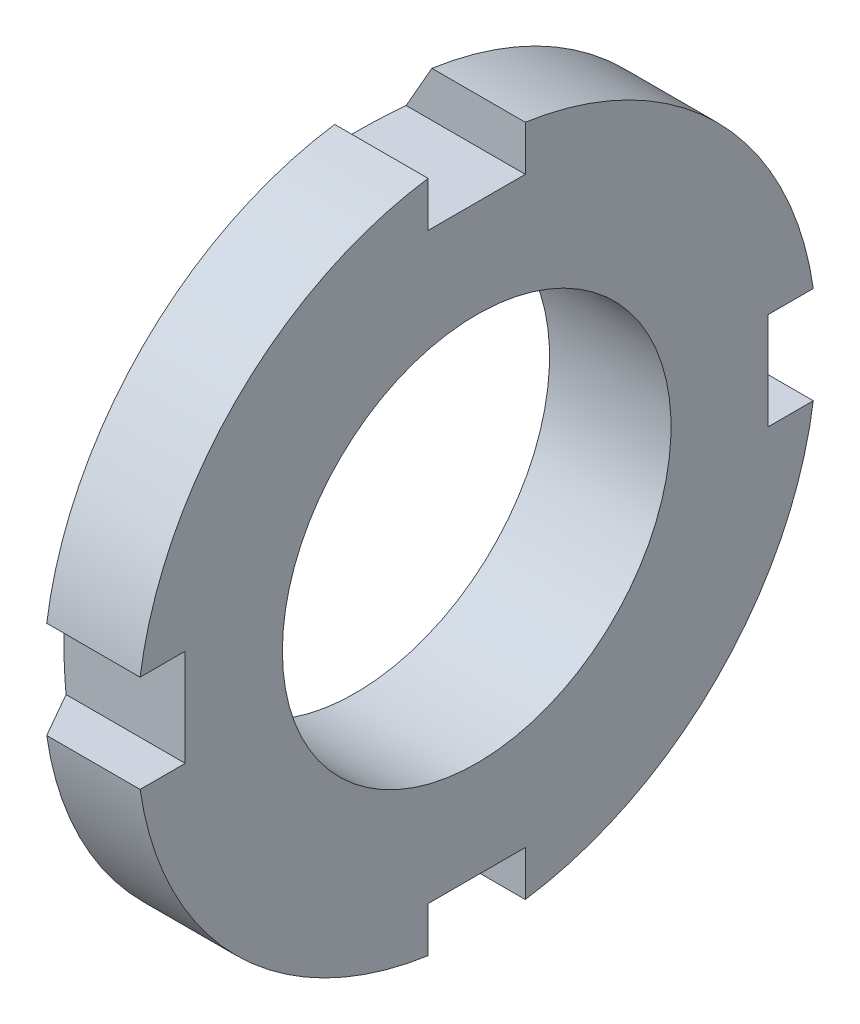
ISO-10303-21;
HEADER;
FILE_DESCRIPTION(('STEP AP214'),'2;1');
FILE_NAME('part.step','',(''),(''),'','','');
FILE_SCHEMA(('AUTOMOTIVE_DESIGN { 1 0 10303 214 1 1 1 1 }'));
ENDSEC;
DATA;
#1=APPLICATION_CONTEXT('core data for automotive mechanical design processes');
#2=APPLICATION_PROTOCOL_DEFINITION('international standard','automotive_design',2000,#1);
#3=PRODUCT_CONTEXT('',#1,'mechanical');
#4=PRODUCT('Part','Part','',(#3));
#5=PRODUCT_RELATED_PRODUCT_CATEGORY('part','',(#4));
#6=PRODUCT_DEFINITION_FORMATION('','',#4);
#7=PRODUCT_DEFINITION_CONTEXT('part definition',#1,'design');
#8=PRODUCT_DEFINITION('design','',#6,#7);
#9=PRODUCT_DEFINITION_SHAPE('','',#8);
#10=(LENGTH_UNIT() NAMED_UNIT(*) SI_UNIT(.MILLI.,.METRE.));
#11=(NAMED_UNIT(*) PLANE_ANGLE_UNIT() SI_UNIT($,.RADIAN.));
#12=(NAMED_UNIT(*) SI_UNIT($,.STERADIAN.) SOLID_ANGLE_UNIT());
#13=UNCERTAINTY_MEASURE_WITH_UNIT(LENGTH_MEASURE(1.E-05),#10,'distance_accuracy_value','');
#14=(GEOMETRIC_REPRESENTATION_CONTEXT(3) GLOBAL_UNCERTAINTY_ASSIGNED_CONTEXT((#13)) GLOBAL_UNIT_ASSIGNED_CONTEXT((#10,
#11,#12)) REPRESENTATION_CONTEXT('',''));
#15=CARTESIAN_POINT('',(0.,0.,0.));
#16=DIRECTION('',(0.,0.,1.));
#17=DIRECTION('',(1.,0.,0.));
#18=AXIS2_PLACEMENT_3D('',#15,#16,#17);
#19=CARTESIAN_POINT('',(1.15470053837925,0.,0.));
#20=DIRECTION('',(1.,0.,0.));
#21=DIRECTION('',(0.,0.,-1.));
#22=AXIS2_PLACEMENT_3D('',#19,#20,#21);
#23=CONICAL_SURFACE('',#22,14.,1.0471975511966);
#24=CARTESIAN_POINT('',(1.15470053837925,0.,0.));
#25=DIRECTION('',(-1.,0.,0.));
#26=DIRECTION('',(0.,0.,1.));
#27=AXIS2_PLACEMENT_3D('',#24,#25,#26);
#28=CIRCLE('',#27,14.);
#29=CARTESIAN_POINT('',(1.15470053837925,-13.856406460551,2.00000000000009));
#30=VERTEX_POINT('',#29);
#31=CARTESIAN_POINT('',(1.15470053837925,-1.99999999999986,13.856406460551));
#32=VERTEX_POINT('',#31);
#33=EDGE_CURVE('E387',#30,#32,#28,.T.);
#34=ORIENTED_EDGE('',*,*,#33,.T.);
#35=CARTESIAN_POINT('',(2.50004039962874,-1.99999999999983,16.2072617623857));
#36=CARTESIAN_POINT('',(2.12445509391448,-1.99999999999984,15.5517207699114));
#37=CARTESIAN_POINT('',(1.74906807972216,-1.99999999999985,14.8960654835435));
#38=CARTESIAN_POINT('',(0.999065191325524,-1.99999999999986,13.584317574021));
#39=CARTESIAN_POINT('',(0.624449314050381,-1.99999999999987,12.9282249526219));
#40=CARTESIAN_POINT('',(0.0633818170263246,-1.99999999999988,11.943596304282));
#41=CARTESIAN_POINT('',(-0.12349831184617,-1.99999999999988,11.6153045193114));
#42=CARTESIAN_POINT('',(-0.496883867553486,-1.99999999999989,10.9585081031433));
#43=CARTESIAN_POINT('',(-0.683389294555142,-1.99999999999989,10.6300034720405));
#44=CARTESIAN_POINT('',(-1.05591906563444,-1.9999999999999,9.97271962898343));
#45=CARTESIAN_POINT('',(-1.24194340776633,-1.9999999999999,9.64394041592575));
#46=CARTESIAN_POINT('',(-1.61332792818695,-1.99999999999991,8.98600649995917));
#47=CARTESIAN_POINT('',(-1.79868810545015,-1.99999999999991,8.65685179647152));
#48=CARTESIAN_POINT('',(-1.98362475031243,-1.99999999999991,8.32745873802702));
#49=B_SPLINE_CURVE_WITH_KNOTS('',3,(#35,#36,#37,#38,#39,#40,#41,#42,#43,#44,#45,#46,#47,#48),
.UNSPECIFIED.,.F.,.F.,(4,2,2,2,2,2,4),(0.,2.2665367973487,4.53306455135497,5.66633267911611,
6.7996003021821,7.93287250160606,9.06614645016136),.UNSPECIFIED.);
#50=CARTESIAN_POINT('',(0.0955659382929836,-1.99999999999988,12.));
#51=VERTEX_POINT('',#50);
#52=EDGE_CURVE('E204',#32,#51,#49,.T.);
#53=ORIENTED_EDGE('',*,*,#52,.T.);
#54=CARTESIAN_POINT('',(1.87795299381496,-9.4151559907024,12.0000000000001));
#55=CARTESIAN_POINT('',(1.76332119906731,-9.09343548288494,12.0000000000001));
#56=CARTESIAN_POINT('',(1.65186650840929,-8.7705581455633,12.0000000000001));
#57=CARTESIAN_POINT('',(1.43640574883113,-8.12223353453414,12.0000000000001));
#58=CARTESIAN_POINT('',(1.3324017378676,-7.79678557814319,12.0000000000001));
#59=CARTESIAN_POINT('',(1.13265277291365,-7.14209874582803,12.0000000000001));
#60=CARTESIAN_POINT('',(1.03693794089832,-6.81285059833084,12.0000000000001));
#61=CARTESIAN_POINT('',(0.855502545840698,-6.15166020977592,12.0000000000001));
#62=CARTESIAN_POINT('',(0.769781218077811,-5.81971817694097,12.0000000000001));
#63=CARTESIAN_POINT('',(0.533895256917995,-4.83703268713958,12.));
#64=CARTESIAN_POINT('',(0.399640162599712,-4.18226816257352,12.));
#65=CARTESIAN_POINT('',(0.23890366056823,-3.19408498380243,12.));
#66=CARTESIAN_POINT('',(0.192115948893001,-2.8638952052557,12.));
#67=CARTESIAN_POINT('',(0.113172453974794,-2.20175423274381,12.));
#68=CARTESIAN_POINT('',(0.0810157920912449,-1.86980314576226,12.));
#69=CARTESIAN_POINT('',(0.0367602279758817,-1.26660614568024,12.));
#70=CARTESIAN_POINT('',(0.0220435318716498,-0.995549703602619,12.));
#71=CARTESIAN_POINT('',(0.00317374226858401,-0.453047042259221,12.));
#72=CARTESIAN_POINT('',(-0.000978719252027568,-0.181600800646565,12.));
#73=CARTESIAN_POINT('',(0.00136769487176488,0.36143217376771,12.));
#74=CARTESIAN_POINT('',(0.00787393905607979,0.633018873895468,12.));
#75=CARTESIAN_POINT('',(0.0314205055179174,1.17571298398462,12.));
#76=CARTESIAN_POINT('',(0.0484600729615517,1.44682042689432,12.));
#77=CARTESIAN_POINT('',(0.0932077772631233,1.99386044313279,12.));
#78=CARTESIAN_POINT('',(0.121131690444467,2.26977527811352,12.));
#79=CARTESIAN_POINT('',(0.187088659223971,2.82040723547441,12.));
#80=CARTESIAN_POINT('',(0.225122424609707,3.0951242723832,12.));
#81=CARTESIAN_POINT('',(0.310597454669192,3.64282065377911,12.));
#82=CARTESIAN_POINT('',(0.358030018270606,3.91580136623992,12.));
#83=CARTESIAN_POINT('',(0.461564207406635,4.46005610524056,12.));
#84=CARTESIAN_POINT('',(0.517663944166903,4.73133049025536,12.));
#85=CARTESIAN_POINT('',(0.577727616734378,5.00169907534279,11.9999999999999));
#86=B_SPLINE_CURVE_WITH_KNOTS('',3,(#54,#55,#56,#57,#58,#59,#60,#61,#62,#63,#64,#65,#66,#67,#68,
#69,#70,#71,#72,#73,#74,#75,#76,#77,#78,#79,#80,#81,#82,#83,#84,#85),.UNSPECIFIED.,.F.,.F.,(4,2,
2,2,2,2,2,2,2,2,2,2,2,2,2,4),(0.,1.02461389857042,2.04950972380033,3.07798598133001,
4.10638348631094,6.10932102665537,7.10952575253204,8.10967040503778,8.9238446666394,
9.7380676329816,10.5528537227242,11.3675814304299,12.199357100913,13.0311911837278,
13.8622587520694,14.6931454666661),.UNSPECIFIED.);
#87=CARTESIAN_POINT('',(0.,1.25693400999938E-13,12.));
#88=VERTEX_POINT('',#87);
#89=EDGE_CURVE('E186',#51,#88,#86,.T.);
#90=ORIENTED_EDGE('',*,*,#89,.T.);
#91=CARTESIAN_POINT('',(0.,0.,0.));
#92=DIRECTION('',(-1.,0.,0.));
#93=DIRECTION('',(0.,0.,1.));
#94=AXIS2_PLACEMENT_3D('',#91,#92,#93);
#95=CIRCLE('',#94,12.);
#96=CARTESIAN_POINT('',(0.,-12.,0.));
#97=VERTEX_POINT('',#96);
#98=EDGE_CURVE('E412',#97,#88,#95,.T.);
#99=ORIENTED_EDGE('',*,*,#98,.F.);
#100=CARTESIAN_POINT('',(1.87795299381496,-12.0000000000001,-9.41515599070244));
#101=CARTESIAN_POINT('',(1.76332119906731,-12.0000000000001,-9.09343548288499));
#102=CARTESIAN_POINT('',(1.65186650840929,-12.0000000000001,-8.77055814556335));
#103=CARTESIAN_POINT('',(1.43640574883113,-12.0000000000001,-8.12223353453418));
#104=CARTESIAN_POINT('',(1.3324017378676,-12.0000000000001,-7.79678557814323));
#105=CARTESIAN_POINT('',(1.13265277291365,-12.,-7.14209874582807));
#106=CARTESIAN_POINT('',(1.03693794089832,-12.,-6.81285059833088));
#107=CARTESIAN_POINT('',(0.855502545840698,-12.,-6.15166020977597));
#108=CARTESIAN_POINT('',(0.76978121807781,-12.,-5.81971817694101));
#109=CARTESIAN_POINT('',(0.533895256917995,-12.,-4.83703268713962));
#110=CARTESIAN_POINT('',(0.399640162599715,-12.,-4.18226816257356));
#111=CARTESIAN_POINT('',(0.23890366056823,-12.,-3.19408498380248));
#112=CARTESIAN_POINT('',(0.192115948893,-12.,-2.86389520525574));
#113=CARTESIAN_POINT('',(0.113172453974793,-12.,-2.20175423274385));
#114=CARTESIAN_POINT('',(0.0810157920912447,-12.,-1.8698031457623));
#115=CARTESIAN_POINT('',(0.0367602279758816,-12.,-1.26660614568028));
#116=CARTESIAN_POINT('',(0.022043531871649,-12.,-0.995549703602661));
#117=CARTESIAN_POINT('',(0.0031737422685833,-12.,-0.453047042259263));
#118=CARTESIAN_POINT('',(-0.000978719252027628,-12.,-0.181600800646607));
#119=CARTESIAN_POINT('',(0.00136769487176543,-12.,0.361432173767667));
#120=CARTESIAN_POINT('',(0.00787393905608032,-12.,0.633018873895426));
#121=CARTESIAN_POINT('',(0.0314205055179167,-12.,1.17571298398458));
#122=CARTESIAN_POINT('',(0.0484600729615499,-12.,1.44682042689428));
#123=CARTESIAN_POINT('',(0.0932077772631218,-12.,1.99386044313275));
#124=CARTESIAN_POINT('',(0.121131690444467,-12.,2.26977527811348));
#125=CARTESIAN_POINT('',(0.187088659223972,-12.,2.82040723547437));
#126=CARTESIAN_POINT('',(0.225122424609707,-12.,3.09512427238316));
#127=CARTESIAN_POINT('',(0.310597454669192,-12.,3.64282065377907));
#128=CARTESIAN_POINT('',(0.358030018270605,-12.,3.91580136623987));
#129=CARTESIAN_POINT('',(0.461564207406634,-12.,4.46005610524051));
#130=CARTESIAN_POINT('',(0.517663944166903,-12.,4.73133049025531));
#131=CARTESIAN_POINT('',(0.577727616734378,-12.,5.00169907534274));
#132=B_SPLINE_CURVE_WITH_KNOTS('',3,(#100,#101,#102,#103,#104,#105,#106,#107,#108,#109,#110,
#111,#112,#113,#114,#115,#116,#117,#118,#119,#120,#121,#122,#123,#124,#125,#126,#127,#128,#129,
#130,#131),.UNSPECIFIED.,.F.,.F.,(4,2,2,2,2,2,2,2,2,2,2,2,2,2,2,4),(0.,1.02461389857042,
2.04950972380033,3.07798598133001,4.10638348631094,6.10932102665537,7.10952575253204,
8.10967040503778,8.9238446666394,9.7380676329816,10.5528537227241,11.3675814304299,
12.199357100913,13.0311911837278,13.8622587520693,14.6931454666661),.UNSPECIFIED.);
#133=CARTESIAN_POINT('',(0.0955659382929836,-12.,2.00000000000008));
#134=VERTEX_POINT('',#133);
#135=EDGE_CURVE('E218',#97,#134,#132,.T.);
#136=ORIENTED_EDGE('',*,*,#135,.T.);
#137=CARTESIAN_POINT('',(-1.20351332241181,-9.71165401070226,2.00000000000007));
#138=CARTESIAN_POINT('',(-1.01756214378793,-10.0404733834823,2.00000000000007));
#139=CARTESIAN_POINT('',(-0.831334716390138,-10.3691362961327,2.00000000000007));
#140=CARTESIAN_POINT('',(-0.45843760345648,-11.0262108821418,2.00000000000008));
#141=CARTESIAN_POINT('',(-0.271767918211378,-11.3546225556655,2.00000000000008));
#142=CARTESIAN_POINT('',(0.288738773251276,-12.3395725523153,2.00000000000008));
#143=CARTESIAN_POINT('',(0.663074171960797,-12.9958271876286,2.00000000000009));
#144=CARTESIAN_POINT('',(1.41257640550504,-14.3078598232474,2.0000000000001));
#145=CARTESIAN_POINT('',(1.78774323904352,-14.9636378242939,2.0000000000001));
#146=CARTESIAN_POINT('',(2.53866102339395,-16.2748611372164,2.00000000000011));
#147=CARTESIAN_POINT('',(2.91441197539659,-16.9303064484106,2.00000000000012));
#148=CARTESIAN_POINT('',(3.290330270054,-17.5856555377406,2.00000000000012));
#149=B_SPLINE_CURVE_WITH_KNOTS('',3,(#137,#138,#139,#140,#141,#142,#143,#144,#145,#146,#147,
#148),.UNSPECIFIED.,.F.,.F.,(4,2,2,2,2,4),(0.,1.1332692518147,2.26653775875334,4.53307016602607,
6.79959904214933,9.06613254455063),.UNSPECIFIED.);
#150=EDGE_CURVE('E531',#134,#30,#149,.T.);
#151=ORIENTED_EDGE('',*,*,#150,.T.);
#152=EDGE_LOOP('',(#34,#53,#90,#99,#136,#151));
#153=FACE_BOUND('',#152,.T.);
#154=ADVANCED_FACE('F32',(#153),#23,.T.);
#155=CARTESIAN_POINT('',(0.,0.,0.));
#156=DIRECTION('',(-1.,0.,0.));
#157=DIRECTION('',(0.,0.,1.));
#158=AXIS2_PLACEMENT_3D('',#155,#156,#157);
#159=CYLINDRICAL_SURFACE('',#158,14.);
#160=CARTESIAN_POINT('',(5.,0.,0.));
#161=DIRECTION('',(-1.,0.,0.));
#162=DIRECTION('',(0.,0.,1.));
#163=AXIS2_PLACEMENT_3D('',#160,#161,#162);
#164=CIRCLE('',#163,14.);
#165=CARTESIAN_POINT('',(5.,-13.856406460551,2.00000000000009));
#166=VERTEX_POINT('',#165);
#167=CARTESIAN_POINT('',(5.,-1.99999999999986,13.856406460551));
#168=VERTEX_POINT('',#167);
#169=EDGE_CURVE('E363',#166,#168,#164,.T.);
#170=ORIENTED_EDGE('',*,*,#169,.T.);
#171=DIRECTION('',(-1.,0.,0.));
#172=VECTOR('',#171,1.);
#173=CARTESIAN_POINT('',(0.,-1.99999999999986,13.856406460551));
#174=LINE('',#173,#172);
#175=EDGE_CURVE('E212',#168,#32,#174,.T.);
#176=ORIENTED_EDGE('',*,*,#175,.T.);
#177=ORIENTED_EDGE('',*,*,#33,.F.);
#178=DIRECTION('',(-1.,0.,0.));
#179=VECTOR('',#178,1.);
#180=CARTESIAN_POINT('',(0.,-13.856406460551,2.00000000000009));
#181=LINE('',#180,#179);
#182=EDGE_CURVE('E226',#30,#166,#181,.F.);
#183=ORIENTED_EDGE('',*,*,#182,.T.);
#184=EDGE_LOOP('',(#170,#176,#177,#183));
#185=FACE_BOUND('',#184,.T.);
#186=ADVANCED_FACE('F426',(#185),#159,.T.);
#187=CARTESIAN_POINT('',(1.15470053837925,-2.00000000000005,-13.856406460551));
#188=VERTEX_POINT('',#187);
#189=CARTESIAN_POINT('',(1.15470053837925,-13.856406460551,-1.99999999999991));
#190=VERTEX_POINT('',#189);
#191=EDGE_CURVE('E347',#188,#190,#28,.T.);
#192=ORIENTED_EDGE('',*,*,#191,.T.);
#193=CARTESIAN_POINT('',(3.29033027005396,-17.5856555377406,-1.99999999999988));
#194=CARTESIAN_POINT('',(2.91441197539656,-16.9303064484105,-1.99999999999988));
#195=CARTESIAN_POINT('',(2.53866102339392,-16.2748611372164,-1.99999999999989));
#196=CARTESIAN_POINT('',(1.7877432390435,-14.9636378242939,-1.9999999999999));
#197=CARTESIAN_POINT('',(1.41257640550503,-14.3078598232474,-1.9999999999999));
#198=CARTESIAN_POINT('',(0.663074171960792,-12.9958271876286,-1.99999999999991));
#199=CARTESIAN_POINT('',(0.288738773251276,-12.3395725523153,-1.99999999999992));
#200=CARTESIAN_POINT('',(-0.271767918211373,-11.3546225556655,-1.99999999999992));
#201=CARTESIAN_POINT('',(-0.458437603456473,-11.0262108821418,-1.99999999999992));
#202=CARTESIAN_POINT('',(-0.831334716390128,-10.3691362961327,-1.99999999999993));
#203=CARTESIAN_POINT('',(-1.01756214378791,-10.0404733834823,-1.99999999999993));
#204=CARTESIAN_POINT('',(-1.20351332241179,-9.71165401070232,-1.99999999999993));
#205=B_SPLINE_CURVE_WITH_KNOTS('',3,(#193,#194,#195,#196,#197,#198,#199,#200,#201,#202,#203,
#204),.UNSPECIFIED.,.F.,.F.,(4,2,2,2,2,4),(0.,2.26653350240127,4.5330623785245,6.79959478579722,
7.93286329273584,9.06613254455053),.UNSPECIFIED.);
#206=CARTESIAN_POINT('',(0.095565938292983,-12.,-1.99999999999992));
#207=VERTEX_POINT('',#206);
#208=EDGE_CURVE('E241',#190,#207,#205,.T.);
#209=ORIENTED_EDGE('',*,*,#208,.T.);
#210=EDGE_CURVE('E225',#207,#97,#132,.T.);
#211=ORIENTED_EDGE('',*,*,#210,.T.);
#212=CARTESIAN_POINT('',(0.,0.,-12.));
#213=VERTEX_POINT('',#212);
#214=EDGE_CURVE('E337',#213,#97,#95,.T.);
#215=ORIENTED_EDGE('',*,*,#214,.F.);
#216=CARTESIAN_POINT('',(0.577727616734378,5.00169907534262,-12.));
#217=CARTESIAN_POINT('',(0.517663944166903,4.73133049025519,-12.));
#218=CARTESIAN_POINT('',(0.461564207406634,4.46005610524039,-12.));
#219=CARTESIAN_POINT('',(0.358030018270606,3.91580136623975,-12.));
#220=CARTESIAN_POINT('',(0.310597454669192,3.64282065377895,-12.));
#221=CARTESIAN_POINT('',(0.225122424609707,3.09512427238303,-12.));
#222=CARTESIAN_POINT('',(0.187088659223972,2.82040723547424,-12.));
#223=CARTESIAN_POINT('',(0.121131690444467,2.26977527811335,-12.));
#224=CARTESIAN_POINT('',(0.0932077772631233,1.99386044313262,-12.));
#225=CARTESIAN_POINT('',(0.0484600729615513,1.44682042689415,-12.));
#226=CARTESIAN_POINT('',(0.0314205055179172,1.17571298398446,-12.));
#227=CARTESIAN_POINT('',(0.00787393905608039,0.633018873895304,-12.));
#228=CARTESIAN_POINT('',(0.001367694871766,0.361432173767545,-12.));
#229=CARTESIAN_POINT('',(-0.000978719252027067,-0.181600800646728,-12.));
#230=CARTESIAN_POINT('',(0.00317374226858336,-0.453047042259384,-12.));
#231=CARTESIAN_POINT('',(0.0220435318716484,-0.995549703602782,-12.));
#232=CARTESIAN_POINT('',(0.0367602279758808,-1.2666061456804,-12.));
#233=CARTESIAN_POINT('',(0.0810157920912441,-1.86980314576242,-12.));
#234=CARTESIAN_POINT('',(0.113172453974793,-2.20175423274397,-12.));
#235=CARTESIAN_POINT('',(0.192115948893,-2.86389520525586,-12.));
#236=CARTESIAN_POINT('',(0.238903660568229,-3.1940849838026,-12.));
#237=CARTESIAN_POINT('',(0.399640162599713,-4.18226816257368,-12.));
#238=CARTESIAN_POINT('',(0.533895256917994,-4.83703268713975,-12.));
#239=CARTESIAN_POINT('',(0.769781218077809,-5.81971817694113,-12.));
#240=CARTESIAN_POINT('',(0.855502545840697,-6.15166020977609,-12.));
#241=CARTESIAN_POINT('',(1.03693794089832,-6.81285059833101,-12.));
#242=CARTESIAN_POINT('',(1.13265277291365,-7.14209874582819,-12.));
#243=CARTESIAN_POINT('',(1.3324017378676,-7.79678557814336,-12.));
#244=CARTESIAN_POINT('',(1.43640574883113,-8.12223353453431,-12.));
#245=CARTESIAN_POINT('',(1.65186650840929,-8.77055814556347,-12.));
#246=CARTESIAN_POINT('',(1.76332119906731,-9.09343548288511,-12.));
#247=CARTESIAN_POINT('',(1.87795299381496,-9.41515599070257,-12.));
#248=B_SPLINE_CURVE_WITH_KNOTS('',3,(#216,#217,#218,#219,#220,#221,#222,#223,#224,#225,#226,
#227,#228,#229,#230,#231,#232,#233,#234,#235,#236,#237,#238,#239,#240,#241,#242,#243,#244,#245,
#246,#247),.UNSPECIFIED.,.F.,.F.,(4,2,2,2,2,2,2,2,2,2,2,2,2,2,2,4),(0.,0.830886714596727,
1.66195428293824,2.49378836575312,3.32556403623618,4.14029174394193,4.95507783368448,
5.76930080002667,6.5834750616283,7.58361971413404,8.5838244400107,10.5867619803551,
11.6151594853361,12.6436357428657,13.6685315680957,14.6931454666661),.UNSPECIFIED.);
#249=CARTESIAN_POINT('',(0.095565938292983,-2.00000000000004,-12.));
#250=VERTEX_POINT('',#249);
#251=EDGE_CURVE('E257',#213,#250,#248,.T.);
#252=ORIENTED_EDGE('',*,*,#251,.T.);
#253=CARTESIAN_POINT('',(-1.20351332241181,-2.00000000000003,-9.71165401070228));
#254=CARTESIAN_POINT('',(-1.01756214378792,-2.00000000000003,-10.0404733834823));
#255=CARTESIAN_POINT('',(-0.831334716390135,-2.00000000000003,-10.3691362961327));
#256=CARTESIAN_POINT('',(-0.458437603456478,-2.00000000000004,-11.0262108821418));
#257=CARTESIAN_POINT('',(-0.271767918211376,-2.00000000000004,-11.3546225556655));
#258=CARTESIAN_POINT('',(0.288738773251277,-2.00000000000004,-12.3395725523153));
#259=CARTESIAN_POINT('',(0.663074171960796,-2.00000000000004,-12.9958271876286));
#260=CARTESIAN_POINT('',(1.41257640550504,-2.00000000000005,-14.3078598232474));
#261=CARTESIAN_POINT('',(1.78774323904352,-2.00000000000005,-14.9636378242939));
#262=CARTESIAN_POINT('',(2.53866102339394,-2.00000000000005,-16.2748611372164));
#263=CARTESIAN_POINT('',(2.91441197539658,-2.00000000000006,-16.9303064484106));
#264=CARTESIAN_POINT('',(3.29033027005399,-2.00000000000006,-17.5856555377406));
#265=B_SPLINE_CURVE_WITH_KNOTS('',3,(#253,#254,#255,#256,#257,#258,#259,#260,#261,#262,#263,
#264),.UNSPECIFIED.,.F.,.F.,(4,2,2,2,2,4),(0.,1.1332692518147,2.26653775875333,4.53307016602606,
6.79959904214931,9.0661325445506),.UNSPECIFIED.);
#266=EDGE_CURVE('E396',#250,#188,#265,.T.);
#267=ORIENTED_EDGE('',*,*,#266,.T.);
#268=EDGE_LOOP('',(#192,#209,#211,#215,#252,#267));
#269=FACE_BOUND('',#268,.T.);
#270=ADVANCED_FACE('F394',(#269),#23,.T.);
#271=CARTESIAN_POINT('',(5.,-2.00000000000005,-13.856406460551));
#272=VERTEX_POINT('',#271);
#273=CARTESIAN_POINT('',(5.,-13.856406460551,-1.99999999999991));
#274=VERTEX_POINT('',#273);
#275=EDGE_CURVE('E342',#272,#274,#164,.T.);
#276=ORIENTED_EDGE('',*,*,#275,.T.);
#277=DIRECTION('',(-1.,0.,0.));
#278=VECTOR('',#277,1.);
#279=CARTESIAN_POINT('',(0.,-13.856406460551,-1.99999999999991));
#280=LINE('',#279,#278);
#281=EDGE_CURVE('E249',#274,#190,#280,.T.);
#282=ORIENTED_EDGE('',*,*,#281,.T.);
#283=ORIENTED_EDGE('',*,*,#191,.F.);
#284=DIRECTION('',(-1.,0.,0.));
#285=VECTOR('',#284,1.);
#286=CARTESIAN_POINT('',(0.,-2.00000000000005,-13.856406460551));
#287=LINE('',#286,#285);
#288=EDGE_CURVE('E265',#188,#272,#287,.F.);
#289=ORIENTED_EDGE('',*,*,#288,.T.);
#290=EDGE_LOOP('',(#276,#282,#283,#289));
#291=FACE_BOUND('',#290,.T.);
#292=ADVANCED_FACE('F360',(#291),#159,.T.);
#293=CARTESIAN_POINT('',(1.15470053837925,13.856406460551,-2.));
#294=VERTEX_POINT('',#293);
#295=CARTESIAN_POINT('',(1.15470053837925,1.99999999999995,-13.856406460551));
#296=VERTEX_POINT('',#295);
#297=EDGE_CURVE('E343',#294,#296,#28,.T.);
#298=ORIENTED_EDGE('',*,*,#297,.T.);
#299=CARTESIAN_POINT('',(3.29033027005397,1.99999999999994,-17.5856555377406));
#300=CARTESIAN_POINT('',(2.91441197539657,1.99999999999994,-16.9303064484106));
#301=CARTESIAN_POINT('',(2.53866102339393,1.99999999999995,-16.2748611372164));
#302=CARTESIAN_POINT('',(1.78774323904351,1.99999999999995,-14.9636378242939));
#303=CARTESIAN_POINT('',(1.41257640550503,1.99999999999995,-14.3078598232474));
#304=CARTESIAN_POINT('',(0.663074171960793,1.99999999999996,-12.9958271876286));
#305=CARTESIAN_POINT('',(0.288738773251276,1.99999999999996,-12.3395725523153));
#306=CARTESIAN_POINT('',(-0.271767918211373,1.99999999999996,-11.3546225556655));
#307=CARTESIAN_POINT('',(-0.458437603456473,1.99999999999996,-11.0262108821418));
#308=CARTESIAN_POINT('',(-0.831334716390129,1.99999999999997,-10.3691362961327));
#309=CARTESIAN_POINT('',(-1.01756214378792,1.99999999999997,-10.0404733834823));
#310=CARTESIAN_POINT('',(-1.2035133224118,1.99999999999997,-9.71165401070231));
#311=B_SPLINE_CURVE_WITH_KNOTS('',3,(#299,#300,#301,#302,#303,#304,#305,#306,#307,#308,#309,
#310),.UNSPECIFIED.,.F.,.F.,(4,2,2,2,2,4),(0.,2.26653350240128,4.53306237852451,
6.79959478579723,7.93286329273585,9.06613254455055),.UNSPECIFIED.);
#312=CARTESIAN_POINT('',(0.095565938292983,1.99999999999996,-12.));
#313=VERTEX_POINT('',#312);
#314=EDGE_CURVE('E281',#296,#313,#311,.T.);
#315=ORIENTED_EDGE('',*,*,#314,.T.);
#316=EDGE_CURVE('E264',#313,#213,#248,.T.);
#317=ORIENTED_EDGE('',*,*,#316,.T.);
#318=CARTESIAN_POINT('',(0.,12.,0.));
#319=VERTEX_POINT('',#318);
#320=EDGE_CURVE('E334',#319,#213,#95,.T.);
#321=ORIENTED_EDGE('',*,*,#320,.F.);
#322=CARTESIAN_POINT('',(0.577727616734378,12.,5.00169907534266));
#323=CARTESIAN_POINT('',(0.517663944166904,12.,4.73133049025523));
#324=CARTESIAN_POINT('',(0.461564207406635,12.,4.46005610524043));
#325=CARTESIAN_POINT('',(0.358030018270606,12.,3.91580136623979));
#326=CARTESIAN_POINT('',(0.310597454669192,12.,3.64282065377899));
#327=CARTESIAN_POINT('',(0.225122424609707,12.,3.09512427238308));
#328=CARTESIAN_POINT('',(0.187088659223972,12.,2.82040723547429));
#329=CARTESIAN_POINT('',(0.121131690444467,12.,2.2697752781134));
#330=CARTESIAN_POINT('',(0.0932077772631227,12.,1.99386044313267));
#331=CARTESIAN_POINT('',(0.048460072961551,12.,1.4468204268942));
#332=CARTESIAN_POINT('',(0.0314205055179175,12.,1.1757129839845));
#333=CARTESIAN_POINT('',(0.00787393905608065,12.,0.633018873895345));
#334=CARTESIAN_POINT('',(0.00136769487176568,12.,0.361432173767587));
#335=CARTESIAN_POINT('',(-0.000978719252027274,12.,-0.181600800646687));
#336=CARTESIAN_POINT('',(0.00317374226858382,12.,-0.453047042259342));
#337=CARTESIAN_POINT('',(0.022043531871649,12.,-0.99554970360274));
#338=CARTESIAN_POINT('',(0.0367602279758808,12.,-1.26660614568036));
#339=CARTESIAN_POINT('',(0.0810157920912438,12.,-1.86980314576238));
#340=CARTESIAN_POINT('',(0.113172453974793,12.,-2.20175423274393));
#341=CARTESIAN_POINT('',(0.192115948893,12.,-2.86389520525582));
#342=CARTESIAN_POINT('',(0.238903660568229,12.,-3.19408498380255));
#343=CARTESIAN_POINT('',(0.399640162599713,12.,-4.18226816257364));
#344=CARTESIAN_POINT('',(0.533895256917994,12.,-4.8370326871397));
#345=CARTESIAN_POINT('',(0.769781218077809,12.,-5.81971817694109));
#346=CARTESIAN_POINT('',(0.855502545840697,12.,-6.15166020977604));
#347=CARTESIAN_POINT('',(1.03693794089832,12.,-6.81285059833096));
#348=CARTESIAN_POINT('',(1.13265277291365,12.,-7.14209874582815));
#349=CARTESIAN_POINT('',(1.3324017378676,12.,-7.79678557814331));
#350=CARTESIAN_POINT('',(1.43640574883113,12.,-8.12223353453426));
#351=CARTESIAN_POINT('',(1.65186650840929,12.,-8.77055814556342));
#352=CARTESIAN_POINT('',(1.76332119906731,12.,-9.09343548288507));
#353=CARTESIAN_POINT('',(1.87795299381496,12.,-9.41515599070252));
#354=B_SPLINE_CURVE_WITH_KNOTS('',3,(#322,#323,#324,#325,#326,#327,#328,#329,#330,#331,#332,
#333,#334,#335,#336,#337,#338,#339,#340,#341,#342,#343,#344,#345,#346,#347,#348,#349,#350,#351,
#352,#353),.UNSPECIFIED.,.F.,.F.,(4,2,2,2,2,2,2,2,2,2,2,2,2,2,2,4),(0.,0.830886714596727,
1.66195428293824,2.49378836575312,3.32556403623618,4.14029174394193,4.95507783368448,
5.76930080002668,6.5834750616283,7.58361971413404,8.5838244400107,10.5867619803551,
11.6151594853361,12.6436357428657,13.6685315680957,14.6931454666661),.UNSPECIFIED.);
#355=CARTESIAN_POINT('',(0.095565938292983,12.,-2.));
#356=VERTEX_POINT('',#355);
#357=EDGE_CURVE('E297',#319,#356,#354,.T.);
#358=ORIENTED_EDGE('',*,*,#357,.T.);
#359=CARTESIAN_POINT('',(-1.98362475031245,8.32745873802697,-2.));
#360=CARTESIAN_POINT('',(-1.79868810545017,8.65685179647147,-2.));
#361=CARTESIAN_POINT('',(-1.61332792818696,8.98600649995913,-2.));
#362=CARTESIAN_POINT('',(-1.24194340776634,9.64394041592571,-2.));
#363=CARTESIAN_POINT('',(-1.05591906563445,9.9727196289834,-2.));
#364=CARTESIAN_POINT('',(-0.683389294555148,10.6300034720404,-2.));
#365=CARTESIAN_POINT('',(-0.496883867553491,10.9585081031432,-2.));
#366=CARTESIAN_POINT('',(-0.123498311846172,11.6153045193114,-2.));
#367=CARTESIAN_POINT('',(0.0633818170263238,11.943596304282,-2.));
#368=CARTESIAN_POINT('',(0.624449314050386,12.9282249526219,-2.));
#369=CARTESIAN_POINT('',(0.999065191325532,13.584317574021,-2.));
#370=CARTESIAN_POINT('',(1.74906807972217,14.8960654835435,-2.));
#371=CARTESIAN_POINT('',(2.1244550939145,15.5517207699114,-2.));
#372=CARTESIAN_POINT('',(2.50004039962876,16.2072617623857,-2.));
#373=B_SPLINE_CURVE_WITH_KNOTS('',3,(#359,#360,#361,#362,#363,#364,#365,#366,#367,#368,#369,
#370,#371,#372),.UNSPECIFIED.,.F.,.F.,(4,2,2,2,2,2,4),(0.,1.13327394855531,2.26654614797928,
3.39981377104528,4.53308189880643,6.79960965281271,9.06614645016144),.UNSPECIFIED.);
#374=EDGE_CURVE('E378',#356,#294,#373,.T.);
#375=ORIENTED_EDGE('',*,*,#374,.T.);
#376=EDGE_LOOP('',(#298,#315,#317,#321,#358,#375));
#377=FACE_BOUND('',#376,.T.);
#378=ADVANCED_FACE('F406',(#377),#23,.T.);
#379=CARTESIAN_POINT('',(5.,13.856406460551,-2.));
#380=VERTEX_POINT('',#379);
#381=CARTESIAN_POINT('',(5.,1.99999999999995,-13.856406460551));
#382=VERTEX_POINT('',#381);
#383=EDGE_CURVE('E338',#380,#382,#164,.T.);
#384=ORIENTED_EDGE('',*,*,#383,.T.);
#385=DIRECTION('',(-1.,0.,0.));
#386=VECTOR('',#385,1.);
#387=CARTESIAN_POINT('',(0.,1.99999999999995,-13.856406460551));
#388=LINE('',#387,#386);
#389=EDGE_CURVE('E289',#382,#296,#388,.T.);
#390=ORIENTED_EDGE('',*,*,#389,.T.);
#391=ORIENTED_EDGE('',*,*,#297,.F.);
#392=DIRECTION('',(-1.,0.,0.));
#393=VECTOR('',#392,1.);
#394=CARTESIAN_POINT('',(0.,13.856406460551,-2.));
#395=LINE('',#394,#393);
#396=EDGE_CURVE('E305',#294,#380,#395,.F.);
#397=ORIENTED_EDGE('',*,*,#396,.T.);
#398=EDGE_LOOP('',(#384,#390,#391,#397));
#399=FACE_BOUND('',#398,.T.);
#400=ADVANCED_FACE('F419',(#399),#159,.T.);
#401=CARTESIAN_POINT('',(0.0955659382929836,2.00000000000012,12.));
#402=VERTEX_POINT('',#401);
#403=EDGE_CURVE('E167',#88,#402,#86,.T.);
#404=ORIENTED_EDGE('',*,*,#403,.T.);
#405=CARTESIAN_POINT('',(-1.98362475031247,2.00000000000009,8.32745873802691));
#406=CARTESIAN_POINT('',(-1.79868810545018,2.00000000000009,8.65685179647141));
#407=CARTESIAN_POINT('',(-1.61332792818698,2.00000000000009,8.98600649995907));
#408=CARTESIAN_POINT('',(-1.24194340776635,2.0000000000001,9.64394041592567));
#409=CARTESIAN_POINT('',(-1.05591906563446,2.0000000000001,9.97271962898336));
#410=CARTESIAN_POINT('',(-0.683389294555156,2.00000000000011,10.6300034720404));
#411=CARTESIAN_POINT('',(-0.496883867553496,2.00000000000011,10.9585081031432));
#412=CARTESIAN_POINT('',(-0.123498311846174,2.00000000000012,11.6153045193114));
#413=CARTESIAN_POINT('',(0.0633818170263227,2.00000000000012,11.9435963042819));
#414=CARTESIAN_POINT('',(0.624449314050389,2.00000000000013,12.9282249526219));
#415=CARTESIAN_POINT('',(0.99906519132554,2.00000000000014,13.584317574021));
#416=CARTESIAN_POINT('',(1.74906807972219,2.00000000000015,14.8960654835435));
#417=CARTESIAN_POINT('',(2.12445509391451,2.00000000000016,15.5517207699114));
#418=CARTESIAN_POINT('',(2.50004039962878,2.00000000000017,16.2072617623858));
#419=B_SPLINE_CURVE_WITH_KNOTS('',3,(#405,#406,#407,#408,#409,#410,#411,#412,#413,#414,#415,
#416,#417,#418),.UNSPECIFIED.,.F.,.F.,(4,2,2,2,2,2,4),(0.,1.13327394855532,2.26654614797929,
3.39981377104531,4.53308189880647,6.79960965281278,9.06614645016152),.UNSPECIFIED.);
#420=CARTESIAN_POINT('',(1.15470053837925,2.00000000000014,13.856406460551));
#421=VERTEX_POINT('',#420);
#422=EDGE_CURVE('E165',#402,#421,#419,.T.);
#423=ORIENTED_EDGE('',*,*,#422,.T.);
#424=CARTESIAN_POINT('',(1.15470053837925,13.856406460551,2.));
#425=VERTEX_POINT('',#424);
#426=EDGE_CURVE('E341',#421,#425,#28,.T.);
#427=ORIENTED_EDGE('',*,*,#426,.T.);
#428=CARTESIAN_POINT('',(2.50004039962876,16.2072617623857,2.));
#429=CARTESIAN_POINT('',(2.12445509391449,15.5517207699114,2.));
#430=CARTESIAN_POINT('',(1.74906807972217,14.8960654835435,2.));
#431=CARTESIAN_POINT('',(0.999065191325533,13.584317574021,2.));
#432=CARTESIAN_POINT('',(0.624449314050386,12.9282249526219,2.));
#433=CARTESIAN_POINT('',(0.0633818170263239,11.943596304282,2.));
#434=CARTESIAN_POINT('',(-0.123498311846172,11.6153045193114,2.));
#435=CARTESIAN_POINT('',(-0.496883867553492,10.9585081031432,2.));
#436=CARTESIAN_POINT('',(-0.68338929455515,10.6300034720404,2.));
#437=CARTESIAN_POINT('',(-1.05591906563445,9.97271962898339,2.));
#438=CARTESIAN_POINT('',(-1.24194340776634,9.6439404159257,2.));
#439=CARTESIAN_POINT('',(-1.61332792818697,8.98600649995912,2.));
#440=CARTESIAN_POINT('',(-1.79868810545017,8.65685179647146,2.));
#441=CARTESIAN_POINT('',(-1.98362475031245,8.32745873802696,2.));
#442=B_SPLINE_CURVE_WITH_KNOTS('',3,(#428,#429,#430,#431,#432,#433,#434,#435,#436,#437,#438,
#439,#440,#441),.UNSPECIFIED.,.F.,.F.,(4,2,2,2,2,2,4),(0.,2.26653679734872,4.53306455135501,
5.66633267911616,6.79960030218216,7.93287250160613,9.06614645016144),.UNSPECIFIED.);
#443=CARTESIAN_POINT('',(0.0955659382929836,12.,2.));
#444=VERTEX_POINT('',#443);
#445=EDGE_CURVE('E319',#425,#444,#442,.T.);
#446=ORIENTED_EDGE('',*,*,#445,.T.);
#447=EDGE_CURVE('E304',#444,#319,#354,.T.);
#448=ORIENTED_EDGE('',*,*,#447,.T.);
#449=EDGE_CURVE('E333',#88,#319,#95,.T.);
#450=ORIENTED_EDGE('',*,*,#449,.F.);
#451=EDGE_LOOP('',(#404,#423,#427,#446,#448,#450));
#452=FACE_BOUND('',#451,.T.);
#453=ADVANCED_FACE('F34',(#452),#23,.T.);
#454=ORIENTED_EDGE('',*,*,#426,.F.);
#455=DIRECTION('',(-1.,0.,0.));
#456=VECTOR('',#455,1.);
#457=CARTESIAN_POINT('',(0.,2.00000000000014,13.856406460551));
#458=LINE('',#457,#456);
#459=CARTESIAN_POINT('',(5.,2.00000000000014,13.856406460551));
#460=VERTEX_POINT('',#459);
#461=EDGE_CURVE('E187',#421,#460,#458,.F.);
#462=ORIENTED_EDGE('',*,*,#461,.T.);
#463=CARTESIAN_POINT('',(5.,13.856406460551,2.));
#464=VERTEX_POINT('',#463);
#465=EDGE_CURVE('E177',#460,#464,#164,.T.);
#466=ORIENTED_EDGE('',*,*,#465,.T.);
#467=DIRECTION('',(-1.,0.,0.));
#468=VECTOR('',#467,1.);
#469=CARTESIAN_POINT('',(0.,13.856406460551,2.));
#470=LINE('',#469,#468);
#471=EDGE_CURVE('E327',#464,#425,#470,.T.);
#472=ORIENTED_EDGE('',*,*,#471,.T.);
#473=EDGE_LOOP('',(#454,#462,#466,#472));
#474=FACE_BOUND('',#473,.T.);
#475=ADVANCED_FACE('F373',(#474),#159,.T.);
#476=CARTESIAN_POINT('',(5.,14.,0.));
#477=DIRECTION('',(-1.,0.,0.));
#478=DIRECTION('',(0.,0.,1.));
#479=AXIS2_PLACEMENT_3D('',#476,#477,#478);
#480=PLANE('',#479);
#481=CARTESIAN_POINT('',(5.,0.,0.));
#482=DIRECTION('',(-1.,0.,0.));
#483=DIRECTION('',(0.,0.,1.));
#484=AXIS2_PLACEMENT_3D('',#481,#482,#483);
#485=CIRCLE('',#484,7.99999999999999);
#486=CARTESIAN_POINT('',(5.,0.,7.99999999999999));
#487=VERTEX_POINT('',#486);
#488=EDGE_CURVE('E330',#487,#487,#485,.T.);
#489=ORIENTED_EDGE('',*,*,#488,.T.);
#490=EDGE_LOOP('',(#489));
#491=FACE_BOUND('',#490,.T.);
#492=DIRECTION('',(0.,1.,0.));
#493=VECTOR('',#492,1.);
#494=CARTESIAN_POINT('',(5.,-1.99999999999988,12.));
#495=LINE('',#494,#493);
#496=CARTESIAN_POINT('',(5.,-1.99999999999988,12.));
#497=VERTEX_POINT('',#496);
#498=CARTESIAN_POINT('',(5.,2.00000000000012,12.));
#499=VERTEX_POINT('',#498);
#500=EDGE_CURVE('E170',#497,#499,#495,.T.);
#501=ORIENTED_EDGE('',*,*,#500,.F.);
#502=DIRECTION('',(0.,0.,1.));
#503=VECTOR('',#502,1.);
#504=CARTESIAN_POINT('',(5.,-2.,1.66180244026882E-13));
#505=LINE('',#504,#503);
#506=EDGE_CURVE('E11',#497,#168,#505,.T.);
#507=ORIENTED_EDGE('',*,*,#506,.T.);
#508=ORIENTED_EDGE('',*,*,#169,.F.);
#509=DIRECTION('',(0.,-1.,0.));
#510=VECTOR('',#509,1.);
#511=CARTESIAN_POINT('',(5.,-16.9178624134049,2.00000000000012));
#512=LINE('',#511,#510);
#513=CARTESIAN_POINT('',(5.,-12.,2.00000000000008));
#514=VERTEX_POINT('',#513);
#515=EDGE_CURVE('E214',#514,#166,#512,.T.);
#516=ORIENTED_EDGE('',*,*,#515,.F.);
#517=DIRECTION('',(0.,0.,1.));
#518=VECTOR('',#517,1.);
#519=CARTESIAN_POINT('',(5.,-12.,-1.99999999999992));
#520=LINE('',#519,#518);
#521=CARTESIAN_POINT('',(5.,-12.,-1.99999999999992));
#522=VERTEX_POINT('',#521);
#523=EDGE_CURVE('E211',#522,#514,#520,.T.);
#524=ORIENTED_EDGE('',*,*,#523,.F.);
#525=DIRECTION('',(0.,-1.,0.));
#526=VECTOR('',#525,1.);
#527=CARTESIAN_POINT('',(5.,14.,-2.0000000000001));
#528=LINE('',#527,#526);
#529=EDGE_CURVE('E41',#522,#274,#528,.T.);
#530=ORIENTED_EDGE('',*,*,#529,.T.);
#531=ORIENTED_EDGE('',*,*,#275,.F.);
#532=DIRECTION('',(0.,0.,-1.));
#533=VECTOR('',#532,1.);
#534=CARTESIAN_POINT('',(5.,-2.00000000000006,-16.9178624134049));
#535=LINE('',#534,#533);
#536=CARTESIAN_POINT('',(5.,-2.00000000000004,-12.));
#537=VERTEX_POINT('',#536);
#538=EDGE_CURVE('E252',#537,#272,#535,.T.);
#539=ORIENTED_EDGE('',*,*,#538,.F.);
#540=DIRECTION('',(0.,-1.,0.));
#541=VECTOR('',#540,1.);
#542=CARTESIAN_POINT('',(5.,1.99999999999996,-12.));
#543=LINE('',#542,#541);
#544=CARTESIAN_POINT('',(5.,1.99999999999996,-12.));
#545=VERTEX_POINT('',#544);
#546=EDGE_CURVE('E248',#545,#537,#543,.T.);
#547=ORIENTED_EDGE('',*,*,#546,.F.);
#548=DIRECTION('',(0.,0.,-1.));
#549=VECTOR('',#548,1.);
#550=CARTESIAN_POINT('',(5.,2.,0.));
#551=LINE('',#550,#549);
#552=EDGE_CURVE('E349',#545,#382,#551,.T.);
#553=ORIENTED_EDGE('',*,*,#552,.T.);
#554=ORIENTED_EDGE('',*,*,#383,.F.);
#555=DIRECTION('',(0.,1.,0.));
#556=VECTOR('',#555,1.);
#557=CARTESIAN_POINT('',(5.,16.9178624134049,-2.));
#558=LINE('',#557,#556);
#559=CARTESIAN_POINT('',(5.,12.,-2.));
#560=VERTEX_POINT('',#559);
#561=EDGE_CURVE('E292',#560,#380,#558,.T.);
#562=ORIENTED_EDGE('',*,*,#561,.F.);
#563=DIRECTION('',(0.,0.,-1.));
#564=VECTOR('',#563,1.);
#565=CARTESIAN_POINT('',(5.,12.,2.));
#566=LINE('',#565,#564);
#567=CARTESIAN_POINT('',(5.,12.,2.));
#568=VERTEX_POINT('',#567);
#569=EDGE_CURVE('E288',#568,#560,#566,.T.);
#570=ORIENTED_EDGE('',*,*,#569,.F.);
#571=DIRECTION('',(0.,1.,0.));
#572=VECTOR('',#571,1.);
#573=CARTESIAN_POINT('',(5.,14.,2.));
#574=LINE('',#573,#572);
#575=EDGE_CURVE('E346',#568,#464,#574,.T.);
#576=ORIENTED_EDGE('',*,*,#575,.T.);
#577=ORIENTED_EDGE('',*,*,#465,.F.);
#578=DIRECTION('',(0.,0.,1.));
#579=VECTOR('',#578,1.);
#580=CARTESIAN_POINT('',(5.,2.00000000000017,16.9178624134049));
#581=LINE('',#580,#579);
#582=EDGE_CURVE('E162',#499,#460,#581,.T.);
#583=ORIENTED_EDGE('',*,*,#582,.F.);
#584=EDGE_LOOP('',(#501,#507,#508,#516,#524,#530,#531,#539,#547,#553,#554,#562,#570,#576,#577,#583));
#585=FACE_BOUND('',#584,.T.);
#586=ADVANCED_FACE('F175',(#491,#585),#480,.F.);
#587=CARTESIAN_POINT('',(0.,0.,0.));
#588=DIRECTION('',(1.,0.,0.));
#589=DIRECTION('',(0.,0.,-1.));
#590=AXIS2_PLACEMENT_3D('',#587,#588,#589);
#591=PLANE('',#590);
#592=CARTESIAN_POINT('',(0.,0.,0.));
#593=DIRECTION('',(-1.,0.,0.));
#594=DIRECTION('',(0.,0.,1.));
#595=AXIS2_PLACEMENT_3D('',#592,#593,#594);
#596=CIRCLE('',#595,7.99999999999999);
#597=CARTESIAN_POINT('',(0.,0.,7.99999999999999));
#598=VERTEX_POINT('',#597);
#599=EDGE_CURVE('E326',#598,#598,#596,.T.);
#600=ORIENTED_EDGE('',*,*,#599,.F.);
#601=EDGE_LOOP('',(#600));
#602=FACE_BOUND('',#601,.T.);
#603=ORIENTED_EDGE('',*,*,#320,.T.);
#604=ORIENTED_EDGE('',*,*,#214,.T.);
#605=ORIENTED_EDGE('',*,*,#98,.T.);
#606=ORIENTED_EDGE('',*,*,#449,.T.);
#607=EDGE_LOOP('',(#603,#604,#605,#606));
#608=FACE_BOUND('',#607,.T.);
#609=ADVANCED_FACE('F413',(#602,#608),#591,.F.);
#610=CARTESIAN_POINT('',(0.,0.,0.));
#611=DIRECTION('',(-1.,0.,0.));
#612=DIRECTION('',(0.,0.,1.));
#613=AXIS2_PLACEMENT_3D('',#610,#611,#612);
#614=CYLINDRICAL_SURFACE('',#613,7.99999999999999);
#615=ORIENTED_EDGE('',*,*,#599,.T.);
#616=EDGE_LOOP('',(#615));
#617=FACE_BOUND('',#616,.T.);
#618=ORIENTED_EDGE('',*,*,#488,.F.);
#619=EDGE_LOOP('',(#618));
#620=FACE_BOUND('',#619,.T.);
#621=ADVANCED_FACE('F315',(#617,#620),#614,.F.);
#622=CARTESIAN_POINT('',(-5.,16.9178624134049,2.));
#623=DIRECTION('',(0.,0.,1.));
#624=DIRECTION('',(0.,-1.,0.));
#625=AXIS2_PLACEMENT_3D('',#622,#623,#624);
#626=PLANE('',#625);
#627=ORIENTED_EDGE('',*,*,#471,.F.);
#628=ORIENTED_EDGE('',*,*,#575,.F.);
#629=DIRECTION('',(1.,0.,0.));
#630=VECTOR('',#629,1.);
#631=CARTESIAN_POINT('',(-5.,12.,2.));
#632=LINE('',#631,#630);
#633=EDGE_CURVE('E294',#444,#568,#632,.T.);
#634=ORIENTED_EDGE('',*,*,#633,.F.);
#635=ORIENTED_EDGE('',*,*,#445,.F.);
#636=EDGE_LOOP('',(#627,#628,#634,#635));
#637=FACE_BOUND('',#636,.T.);
#638=ADVANCED_FACE('F311',(#637),#626,.F.);
#639=CARTESIAN_POINT('',(-5.,16.9178624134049,-2.));
#640=DIRECTION('',(0.,0.,-1.));
#641=DIRECTION('',(0.,1.,0.));
#642=AXIS2_PLACEMENT_3D('',#639,#640,#641);
#643=PLANE('',#642);
#644=DIRECTION('',(1.,0.,0.));
#645=VECTOR('',#644,1.);
#646=CARTESIAN_POINT('',(-5.,12.,-2.));
#647=LINE('',#646,#645);
#648=EDGE_CURVE('E295',#356,#560,#647,.T.);
#649=ORIENTED_EDGE('',*,*,#648,.T.);
#650=ORIENTED_EDGE('',*,*,#561,.T.);
#651=ORIENTED_EDGE('',*,*,#396,.F.);
#652=ORIENTED_EDGE('',*,*,#374,.F.);
#653=EDGE_LOOP('',(#649,#650,#651,#652));
#654=FACE_BOUND('',#653,.T.);
#655=ADVANCED_FACE('F277',(#654),#643,.F.);
#656=CARTESIAN_POINT('',(-5.,12.,2.));
#657=DIRECTION('',(0.,-1.,0.));
#658=DIRECTION('',(0.,0.,-1.));
#659=AXIS2_PLACEMENT_3D('',#656,#657,#658);
#660=PLANE('',#659);
#661=ORIENTED_EDGE('',*,*,#633,.T.);
#662=ORIENTED_EDGE('',*,*,#569,.T.);
#663=ORIENTED_EDGE('',*,*,#648,.F.);
#664=ORIENTED_EDGE('',*,*,#357,.F.);
#665=ORIENTED_EDGE('',*,*,#447,.F.);
#666=EDGE_LOOP('',(#661,#662,#663,#664,#665));
#667=FACE_BOUND('',#666,.T.);
#668=ADVANCED_FACE('F275',(#667),#660,.F.);
#669=CARTESIAN_POINT('',(-5.,1.99999999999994,-16.9178624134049));
#670=DIRECTION('',(0.,1.,0.));
#671=DIRECTION('',(0.,0.,1.));
#672=AXIS2_PLACEMENT_3D('',#669,#670,#671);
#673=PLANE('',#672);
#674=ORIENTED_EDGE('',*,*,#389,.F.);
#675=ORIENTED_EDGE('',*,*,#552,.F.);
#676=DIRECTION('',(1.,0.,0.));
#677=VECTOR('',#676,1.);
#678=CARTESIAN_POINT('',(-5.,1.99999999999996,-12.));
#679=LINE('',#678,#677);
#680=EDGE_CURVE('E254',#313,#545,#679,.T.);
#681=ORIENTED_EDGE('',*,*,#680,.F.);
#682=ORIENTED_EDGE('',*,*,#314,.F.);
#683=EDGE_LOOP('',(#674,#675,#681,#682));
#684=FACE_BOUND('',#683,.T.);
#685=ADVANCED_FACE('F271',(#684),#673,.F.);
#686=CARTESIAN_POINT('',(-5.,-2.00000000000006,-16.9178624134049));
#687=DIRECTION('',(0.,-1.,0.));
#688=DIRECTION('',(0.,0.,-1.));
#689=AXIS2_PLACEMENT_3D('',#686,#687,#688);
#690=PLANE('',#689);
#691=DIRECTION('',(1.,0.,0.));
#692=VECTOR('',#691,1.);
#693=CARTESIAN_POINT('',(-5.,-2.00000000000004,-12.));
#694=LINE('',#693,#692);
#695=EDGE_CURVE('E255',#250,#537,#694,.T.);
#696=ORIENTED_EDGE('',*,*,#695,.T.);
#697=ORIENTED_EDGE('',*,*,#538,.T.);
#698=ORIENTED_EDGE('',*,*,#288,.F.);
#699=ORIENTED_EDGE('',*,*,#266,.F.);
#700=EDGE_LOOP('',(#696,#697,#698,#699));
#701=FACE_BOUND('',#700,.T.);
#702=ADVANCED_FACE('F237',(#701),#690,.F.);
#703=CARTESIAN_POINT('',(-5.,1.99999999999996,-12.));
#704=DIRECTION('',(0.,0.,1.));
#705=DIRECTION('',(0.,-1.,0.));
#706=AXIS2_PLACEMENT_3D('',#703,#704,#705);
#707=PLANE('',#706);
#708=ORIENTED_EDGE('',*,*,#680,.T.);
#709=ORIENTED_EDGE('',*,*,#546,.T.);
#710=ORIENTED_EDGE('',*,*,#695,.F.);
#711=ORIENTED_EDGE('',*,*,#251,.F.);
#712=ORIENTED_EDGE('',*,*,#316,.F.);
#713=EDGE_LOOP('',(#708,#709,#710,#711,#712));
#714=FACE_BOUND('',#713,.T.);
#715=ADVANCED_FACE('F235',(#714),#707,.F.);
#716=CARTESIAN_POINT('',(-5.,-16.9178624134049,-1.99999999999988));
#717=DIRECTION('',(0.,0.,-1.));
#718=DIRECTION('',(0.,1.,0.));
#719=AXIS2_PLACEMENT_3D('',#716,#717,#718);
#720=PLANE('',#719);
#721=ORIENTED_EDGE('',*,*,#281,.F.);
#722=ORIENTED_EDGE('',*,*,#529,.F.);
#723=DIRECTION('',(1.,0.,0.));
#724=VECTOR('',#723,1.);
#725=CARTESIAN_POINT('',(-5.,-12.,-1.99999999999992));
#726=LINE('',#725,#724);
#727=EDGE_CURVE('E56',#207,#522,#726,.T.);
#728=ORIENTED_EDGE('',*,*,#727,.F.);
#729=ORIENTED_EDGE('',*,*,#208,.F.);
#730=EDGE_LOOP('',(#721,#722,#728,#729));
#731=FACE_BOUND('',#730,.T.);
#732=ADVANCED_FACE('F231',(#731),#720,.F.);
#733=CARTESIAN_POINT('',(-5.,-16.9178624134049,2.00000000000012));
#734=DIRECTION('',(0.,0.,1.));
#735=DIRECTION('',(0.,-1.,0.));
#736=AXIS2_PLACEMENT_3D('',#733,#734,#735);
#737=PLANE('',#736);
#738=DIRECTION('',(1.,0.,0.));
#739=VECTOR('',#738,1.);
#740=CARTESIAN_POINT('',(-5.,-12.,2.00000000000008));
#741=LINE('',#740,#739);
#742=EDGE_CURVE('E216',#134,#514,#741,.T.);
#743=ORIENTED_EDGE('',*,*,#742,.T.);
#744=ORIENTED_EDGE('',*,*,#515,.T.);
#745=ORIENTED_EDGE('',*,*,#182,.F.);
#746=ORIENTED_EDGE('',*,*,#150,.F.);
#747=EDGE_LOOP('',(#743,#744,#745,#746));
#748=FACE_BOUND('',#747,.T.);
#749=ADVANCED_FACE('F200',(#748),#737,.F.);
#750=CARTESIAN_POINT('',(-5.,-12.,-1.99999999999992));
#751=DIRECTION('',(0.,1.,0.));
#752=DIRECTION('',(0.,0.,1.));
#753=AXIS2_PLACEMENT_3D('',#750,#751,#752);
#754=PLANE('',#753);
#755=ORIENTED_EDGE('',*,*,#727,.T.);
#756=ORIENTED_EDGE('',*,*,#523,.T.);
#757=ORIENTED_EDGE('',*,*,#742,.F.);
#758=ORIENTED_EDGE('',*,*,#135,.F.);
#759=ORIENTED_EDGE('',*,*,#210,.F.);
#760=EDGE_LOOP('',(#755,#756,#757,#758,#759));
#761=FACE_BOUND('',#760,.T.);
#762=ADVANCED_FACE('F198',(#761),#754,.F.);
#763=CARTESIAN_POINT('',(-5.,-1.99999999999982,16.9178624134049));
#764=DIRECTION('',(0.,-1.,0.));
#765=DIRECTION('',(0.,0.,-1.));
#766=AXIS2_PLACEMENT_3D('',#763,#764,#765);
#767=PLANE('',#766);
#768=ORIENTED_EDGE('',*,*,#175,.F.);
#769=ORIENTED_EDGE('',*,*,#506,.F.);
#770=DIRECTION('',(1.,0.,0.));
#771=VECTOR('',#770,1.);
#772=CARTESIAN_POINT('',(-5.,-1.99999999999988,12.));
#773=LINE('',#772,#771);
#774=EDGE_CURVE('E48',#51,#497,#773,.T.);
#775=ORIENTED_EDGE('',*,*,#774,.F.);
#776=ORIENTED_EDGE('',*,*,#52,.F.);
#777=EDGE_LOOP('',(#768,#769,#775,#776));
#778=FACE_BOUND('',#777,.T.);
#779=ADVANCED_FACE('F194',(#778),#767,.F.);
#780=CARTESIAN_POINT('',(-5.,2.00000000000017,16.9178624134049));
#781=DIRECTION('',(0.,1.,0.));
#782=DIRECTION('',(0.,0.,1.));
#783=AXIS2_PLACEMENT_3D('',#780,#781,#782);
#784=PLANE('',#783);
#785=DIRECTION('',(1.,0.,0.));
#786=VECTOR('',#785,1.);
#787=CARTESIAN_POINT('',(-5.,2.00000000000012,12.));
#788=LINE('',#787,#786);
#789=EDGE_CURVE('E159',#402,#499,#788,.T.);
#790=ORIENTED_EDGE('',*,*,#789,.T.);
#791=ORIENTED_EDGE('',*,*,#582,.T.);
#792=ORIENTED_EDGE('',*,*,#461,.F.);
#793=ORIENTED_EDGE('',*,*,#422,.F.);
#794=EDGE_LOOP('',(#790,#791,#792,#793));
#795=FACE_BOUND('',#794,.T.);
#796=ADVANCED_FACE('F160',(#795),#784,.F.);
#797=CARTESIAN_POINT('',(-5.,-1.99999999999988,12.));
#798=DIRECTION('',(0.,0.,-1.));
#799=DIRECTION('',(0.,1.,0.));
#800=AXIS2_PLACEMENT_3D('',#797,#798,#799);
#801=PLANE('',#800);
#802=ORIENTED_EDGE('',*,*,#774,.T.);
#803=ORIENTED_EDGE('',*,*,#500,.T.);
#804=ORIENTED_EDGE('',*,*,#789,.F.);
#805=ORIENTED_EDGE('',*,*,#403,.F.);
#806=ORIENTED_EDGE('',*,*,#89,.F.);
#807=EDGE_LOOP('',(#802,#803,#804,#805,#806));
#808=FACE_BOUND('',#807,.T.);
#809=ADVANCED_FACE('F171',(#808),#801,.F.);
#810=CLOSED_SHELL('',(#154,#186,#270,#292,#378,#400,#453,#475,#586,#609,#621,#638,#655,#668,
#685,#702,#715,#732,#749,#762,#779,#796,#809));
#811=MANIFOLD_SOLID_BREP('B2',#810);
#812=ADVANCED_BREP_SHAPE_REPRESENTATION('',(#18,#811),#14);
#813=SHAPE_DEFINITION_REPRESENTATION(#9,#812);
ENDSEC;
END-ISO-10303-21;
